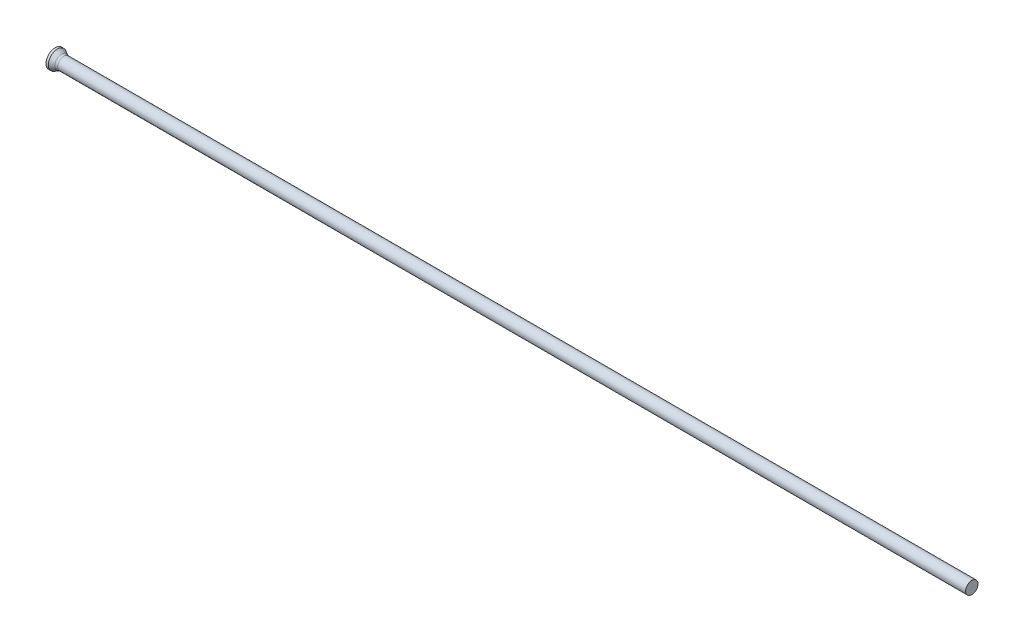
ISO-10303-21;
HEADER;
FILE_DESCRIPTION(('STEP AP214'),'2;1');
FILE_NAME('part.step','',(''),(''),'','','');
FILE_SCHEMA(('AUTOMOTIVE_DESIGN { 1 0 10303 214 1 1 1 1 }'));
ENDSEC;
DATA;
#1=APPLICATION_CONTEXT('core data for automotive mechanical design processes');
#2=APPLICATION_PROTOCOL_DEFINITION('international standard','automotive_design',2000,#1);
#3=PRODUCT_CONTEXT('',#1,'mechanical');
#4=PRODUCT('Part','Part','',(#3));
#5=PRODUCT_RELATED_PRODUCT_CATEGORY('part','',(#4));
#6=PRODUCT_DEFINITION_FORMATION('','',#4);
#7=PRODUCT_DEFINITION_CONTEXT('part definition',#1,'design');
#8=PRODUCT_DEFINITION('design','',#6,#7);
#9=PRODUCT_DEFINITION_SHAPE('','',#8);
#10=(LENGTH_UNIT() NAMED_UNIT(*) SI_UNIT(.MILLI.,.METRE.));
#11=(NAMED_UNIT(*) PLANE_ANGLE_UNIT() SI_UNIT($,.RADIAN.));
#12=(NAMED_UNIT(*) SI_UNIT($,.STERADIAN.) SOLID_ANGLE_UNIT());
#13=UNCERTAINTY_MEASURE_WITH_UNIT(LENGTH_MEASURE(1.E-05),#10,'distance_accuracy_value','');
#14=(GEOMETRIC_REPRESENTATION_CONTEXT(3) GLOBAL_UNCERTAINTY_ASSIGNED_CONTEXT((#13)) GLOBAL_UNIT_ASSIGNED_CONTEXT((#10,
#11,#12)) REPRESENTATION_CONTEXT('',''));
#15=CARTESIAN_POINT('',(0.,0.,0.));
#16=DIRECTION('',(0.,0.,1.));
#17=DIRECTION('',(1.,0.,0.));
#18=AXIS2_PLACEMENT_3D('',#15,#16,#17);
#19=CARTESIAN_POINT('',(0.,0.,0.));
#20=DIRECTION('',(1.,0.,0.));
#21=DIRECTION('',(0.,0.,-1.));
#22=AXIS2_PLACEMENT_3D('',#19,#20,#21);
#23=PLANE('',#22);
#24=CARTESIAN_POINT('',(0.,0.,0.));
#25=DIRECTION('',(-1.,0.,0.));
#26=DIRECTION('',(0.,0.,1.));
#27=AXIS2_PLACEMENT_3D('',#24,#25,#26);
#28=CIRCLE('',#27,2.);
#29=CARTESIAN_POINT('',(0.,0.,2.));
#30=VERTEX_POINT('',#29);
#31=EDGE_CURVE('E25',#30,#30,#28,.T.);
#32=ORIENTED_EDGE('',*,*,#31,.T.);
#33=EDGE_LOOP('',(#32));
#34=FACE_BOUND('',#33,.T.);
#35=ADVANCED_FACE('F14',(#34),#23,.F.);
#36=CARTESIAN_POINT('',(0.,0.,0.));
#37=DIRECTION('',(-1.,0.,0.));
#38=DIRECTION('',(0.,0.,1.));
#39=AXIS2_PLACEMENT_3D('',#36,#37,#38);
#40=CYLINDRICAL_SURFACE('',#39,2.);
#41=ORIENTED_EDGE('',*,*,#31,.F.);
#42=EDGE_LOOP('',(#41));
#43=FACE_BOUND('',#42,.T.);
#44=CARTESIAN_POINT('',(0.504166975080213,0.,0.));
#45=DIRECTION('',(-1.,0.,0.));
#46=DIRECTION('',(0.,0.,1.));
#47=AXIS2_PLACEMENT_3D('',#44,#45,#46);
#48=CIRCLE('',#47,2.);
#49=CARTESIAN_POINT('',(0.504166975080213,0.,2.));
#50=VERTEX_POINT('',#49);
#51=EDGE_CURVE('E29',#50,#50,#48,.T.);
#52=ORIENTED_EDGE('',*,*,#51,.T.);
#53=EDGE_LOOP('',(#52));
#54=FACE_BOUND('',#53,.T.);
#55=ADVANCED_FACE('F53',(#43,#54),#40,.T.);
#56=CARTESIAN_POINT('',(1.63,0.,0.));
#57=DIRECTION('',(-1.,0.,0.));
#58=DIRECTION('',(0.,0.,1.));
#59=AXIS2_PLACEMENT_3D('',#56,#57,#58);
#60=CONICAL_SURFACE('',#59,1.35,0.523598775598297);
#61=CARTESIAN_POINT('',(1.39794919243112,0.,0.));
#62=DIRECTION('',(-1.,0.,0.));
#63=DIRECTION('',(0.,0.,1.));
#64=AXIS2_PLACEMENT_3D('',#61,#62,#63);
#65=CIRCLE('',#64,1.48397459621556);
#66=CARTESIAN_POINT('',(1.39794919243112,0.,1.48397459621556));
#67=VERTEX_POINT('',#66);
#68=EDGE_CURVE('E21',#67,#67,#65,.T.);
#69=ORIENTED_EDGE('',*,*,#68,.T.);
#70=EDGE_LOOP('',(#69));
#71=FACE_BOUND('',#70,.T.);
#72=ORIENTED_EDGE('',*,*,#51,.F.);
#73=EDGE_LOOP('',(#72));
#74=FACE_BOUND('',#73,.T.);
#75=ADVANCED_FACE('F50',(#71,#74),#60,.T.);
#76=CARTESIAN_POINT('',(0.,0.,0.));
#77=DIRECTION('',(-1.,0.,0.));
#78=DIRECTION('',(0.,0.,1.));
#79=AXIS2_PLACEMENT_3D('',#76,#77,#78);
#80=CYLINDRICAL_SURFACE('',#79,1.35);
#81=CARTESIAN_POINT('',(1.89794919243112,0.,0.));
#82=DIRECTION('',(-1.,0.,0.));
#83=DIRECTION('',(0.,0.,1.));
#84=AXIS2_PLACEMENT_3D('',#81,#82,#83);
#85=CIRCLE('',#84,1.35);
#86=CARTESIAN_POINT('',(1.89794919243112,0.,1.35));
#87=VERTEX_POINT('',#86);
#88=EDGE_CURVE('E9',#87,#87,#85,.F.);
#89=ORIENTED_EDGE('',*,*,#88,.T.);
#90=EDGE_LOOP('',(#89));
#91=FACE_BOUND('',#90,.T.);
#92=CARTESIAN_POINT('',(200.,0.,0.));
#93=DIRECTION('',(-1.,0.,0.));
#94=DIRECTION('',(0.,0.,1.));
#95=AXIS2_PLACEMENT_3D('',#92,#93,#94);
#96=CIRCLE('',#95,1.35);
#97=CARTESIAN_POINT('',(200.,0.,1.35));
#98=VERTEX_POINT('',#97);
#99=EDGE_CURVE('E34',#98,#98,#96,.T.);
#100=ORIENTED_EDGE('',*,*,#99,.T.);
#101=EDGE_LOOP('',(#100));
#102=FACE_BOUND('',#101,.T.);
#103=ADVANCED_FACE('F38',(#91,#102),#80,.T.);
#104=CARTESIAN_POINT('',(200.,1.35,0.));
#105=DIRECTION('',(-1.,0.,0.));
#106=DIRECTION('',(0.,0.,1.));
#107=AXIS2_PLACEMENT_3D('',#104,#105,#106);
#108=PLANE('',#107);
#109=ORIENTED_EDGE('',*,*,#99,.F.);
#110=EDGE_LOOP('',(#109));
#111=FACE_BOUND('',#110,.T.);
#112=ADVANCED_FACE('F40',(#111),#108,.F.);
#113=CARTESIAN_POINT('',(1.89794919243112,0.,0.));
#114=DIRECTION('',(-1.,0.,0.));
#115=DIRECTION('',(0.,0.,1.));
#116=AXIS2_PLACEMENT_3D('',#113,#114,#115);
#117=TOROIDAL_SURFACE('',#116,2.35,1.);
#118=ORIENTED_EDGE('',*,*,#88,.F.);
#119=EDGE_LOOP('',(#118));
#120=FACE_BOUND('',#119,.T.);
#121=ORIENTED_EDGE('',*,*,#68,.F.);
#122=EDGE_LOOP('',(#121));
#123=FACE_BOUND('',#122,.T.);
#124=ADVANCED_FACE('F16',(#120,#123),#117,.F.);
#125=CLOSED_SHELL('',(#35,#55,#75,#103,#112,#124));
#126=MANIFOLD_SOLID_BREP('B1',#125);
#127=ADVANCED_BREP_SHAPE_REPRESENTATION('',(#18,#126),#14);
#128=SHAPE_DEFINITION_REPRESENTATION(#9,#127);
ENDSEC;
END-ISO-10303-21;
